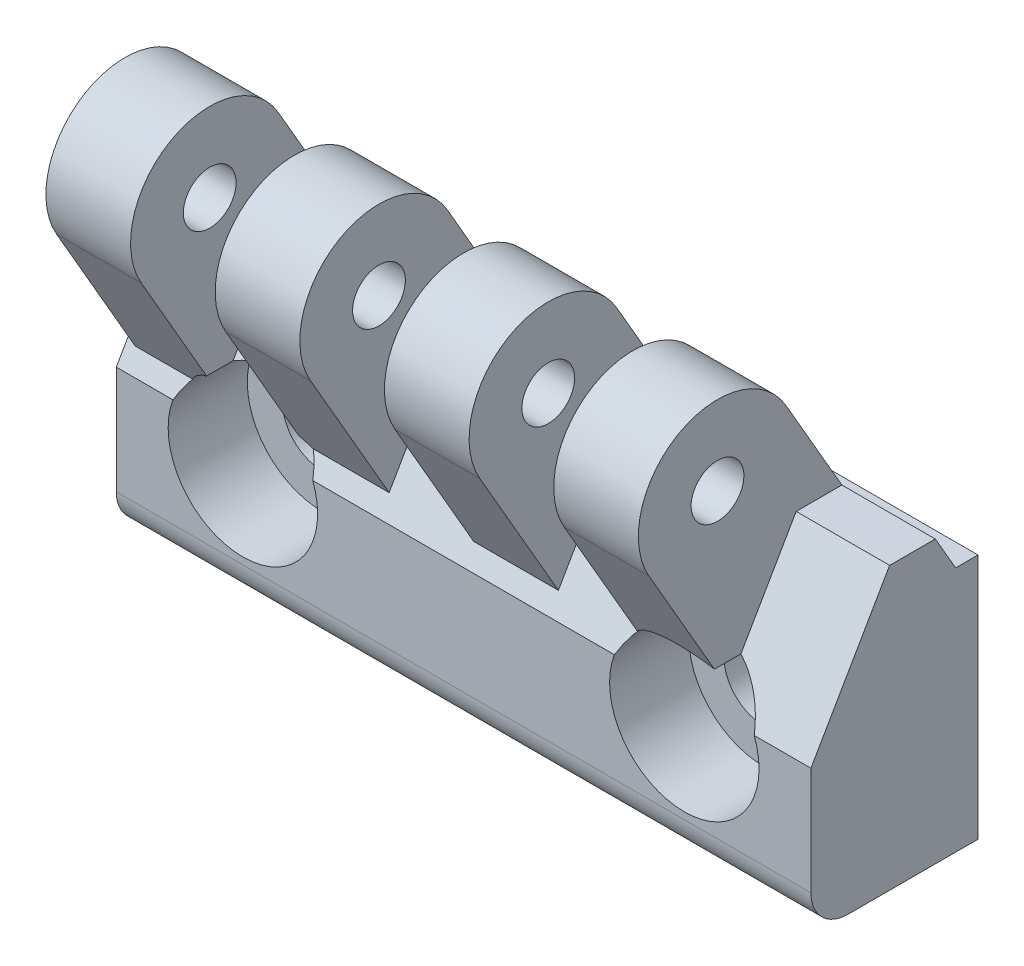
ISO-10303-21;
HEADER;
FILE_DESCRIPTION(('STEP AP214'),'2;1');
FILE_NAME('part.step','',(''),(''),'','','');
FILE_SCHEMA(('AUTOMOTIVE_DESIGN { 1 0 10303 214 1 1 1 1 }'));
ENDSEC;
DATA;
#1=APPLICATION_CONTEXT('core data for automotive mechanical design processes');
#2=APPLICATION_PROTOCOL_DEFINITION('international standard','automotive_design',2000,#1);
#3=PRODUCT_CONTEXT('',#1,'mechanical');
#4=PRODUCT('Part','Part','',(#3));
#5=PRODUCT_RELATED_PRODUCT_CATEGORY('part','',(#4));
#6=PRODUCT_DEFINITION_FORMATION('','',#4);
#7=PRODUCT_DEFINITION_CONTEXT('part definition',#1,'design');
#8=PRODUCT_DEFINITION('design','',#6,#7);
#9=PRODUCT_DEFINITION_SHAPE('','',#8);
#10=(LENGTH_UNIT() NAMED_UNIT(*) SI_UNIT(.MILLI.,.METRE.));
#11=(NAMED_UNIT(*) PLANE_ANGLE_UNIT() SI_UNIT($,.RADIAN.));
#12=(NAMED_UNIT(*) SI_UNIT($,.STERADIAN.) SOLID_ANGLE_UNIT());
#13=UNCERTAINTY_MEASURE_WITH_UNIT(LENGTH_MEASURE(1.E-05),#10,'distance_accuracy_value','');
#14=(GEOMETRIC_REPRESENTATION_CONTEXT(3) GLOBAL_UNCERTAINTY_ASSIGNED_CONTEXT((#13)) GLOBAL_UNIT_ASSIGNED_CONTEXT((#10,
#11,#12)) REPRESENTATION_CONTEXT('',''));
#15=CARTESIAN_POINT('',(0.,0.,0.));
#16=DIRECTION('',(0.,0.,1.));
#17=DIRECTION('',(1.,0.,0.));
#18=AXIS2_PLACEMENT_3D('',#15,#16,#17);
#19=CARTESIAN_POINT('',(32.3,9.25,5.0255354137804));
#20=DIRECTION('',(0.,-0.5,-0.866025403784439));
#21=DIRECTION('',(0.,0.866025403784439,-0.5));
#22=AXIS2_PLACEMENT_3D('',#19,#20,#21);
#23=PLANE('',#22);
#24=CARTESIAN_POINT('',(0.,0.,10.3660254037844));
#25=DIRECTION('',(0.,-0.5,-0.866025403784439));
#26=DIRECTION('',(0.,0.866025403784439,-0.5));
#27=AXIS2_PLACEMENT_3D('',#24,#25,#26);
#28=ELLIPSE('',#27,4.90747728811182,4.25);
#29=CARTESIAN_POINT('',(-3.4369317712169,2.5,8.92264973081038));
#30=VERTEX_POINT('',#29);
#31=CARTESIAN_POINT('',(-3.9764934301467,1.5,9.5));
#32=VERTEX_POINT('',#31);
#33=EDGE_CURVE('E560',#30,#32,#28,.F.);
#34=ORIENTED_EDGE('',*,*,#33,.F.);
#35=DIRECTION('',(-1.,0.,0.));
#36=VECTOR('',#35,1.);
#37=CARTESIAN_POINT('',(32.3,2.5,8.92264973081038));
#38=LINE('',#37,#36);
#39=CARTESIAN_POINT('',(-6.7,2.5,8.92264973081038));
#40=VERTEX_POINT('',#39);
#41=EDGE_CURVE('E240',#30,#40,#38,.T.);
#42=ORIENTED_EDGE('',*,*,#41,.T.);
#43=DIRECTION('',(0.,-0.866025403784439,0.5));
#44=VECTOR('',#43,1.);
#45=CARTESIAN_POINT('',(-6.7,9.25,5.0255354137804));
#46=LINE('',#45,#44);
#47=CARTESIAN_POINT('',(-6.7,9.25,5.0255354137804));
#48=VERTEX_POINT('',#47);
#49=EDGE_CURVE('E266',#48,#40,#46,.T.);
#50=ORIENTED_EDGE('',*,*,#49,.F.);
#51=DIRECTION('',(-1.,0.,0.));
#52=VECTOR('',#51,1.);
#53=CARTESIAN_POINT('',(32.3,9.25,5.0255354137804));
#54=LINE('',#53,#52);
#55=CARTESIAN_POINT('',(-7.2,9.25,5.0255354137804));
#56=VERTEX_POINT('',#55);
#57=EDGE_CURVE('E379',#48,#56,#54,.T.);
#58=ORIENTED_EDGE('',*,*,#57,.T.);
#59=DIRECTION('',(0.,-0.866025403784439,0.5));
#60=VECTOR('',#59,1.);
#61=CARTESIAN_POINT('',(-7.2,9.25,5.0255354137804));
#62=LINE('',#61,#60);
#63=CARTESIAN_POINT('',(-7.2,1.5,9.5));
#64=VERTEX_POINT('',#63);
#65=EDGE_CURVE('E369',#56,#64,#62,.T.);
#66=ORIENTED_EDGE('',*,*,#65,.T.);
#67=DIRECTION('',(-1.,0.,0.));
#68=VECTOR('',#67,1.);
#69=CARTESIAN_POINT('',(32.3,1.5,9.5));
#70=LINE('',#69,#68);
#71=EDGE_CURVE('E375',#32,#64,#70,.T.);
#72=ORIENTED_EDGE('',*,*,#71,.F.);
#73=EDGE_LOOP('',(#34,#42,#50,#58,#66,#72));
#74=FACE_BOUND('',#73,.T.);
#75=ADVANCED_FACE('F14',(#74),#23,.F.);
#76=CARTESIAN_POINT('',(3.97649343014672,1.5,9.5));
#77=VERTEX_POINT('',#76);
#78=CARTESIAN_POINT('',(3.43693177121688,2.5,8.92264973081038));
#79=VERTEX_POINT('',#78);
#80=EDGE_CURVE('E552',#77,#79,#28,.F.);
#81=ORIENTED_EDGE('',*,*,#80,.F.);
#82=CARTESIAN_POINT('',(21.1235065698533,1.5,9.5));
#83=VERTEX_POINT('',#82);
#84=EDGE_CURVE('E380',#83,#77,#70,.T.);
#85=ORIENTED_EDGE('',*,*,#84,.F.);
#86=CARTESIAN_POINT('',(25.1,0.,10.3660254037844));
#87=DIRECTION('',(0.,-0.5,-0.866025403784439));
#88=DIRECTION('',(0.,0.866025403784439,-0.5));
#89=AXIS2_PLACEMENT_3D('',#86,#87,#88);
#90=ELLIPSE('',#89,4.90747728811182,4.25);
#91=CARTESIAN_POINT('',(22.175,3.08332207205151,8.58586857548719));
#92=VERTEX_POINT('',#91);
#93=EDGE_CURVE('E427',#92,#83,#90,.F.);
#94=ORIENTED_EDGE('',*,*,#93,.F.);
#95=DIRECTION('',(0.,-0.866025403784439,0.5));
#96=VECTOR('',#95,1.);
#97=CARTESIAN_POINT('',(22.175,9.25,5.0255354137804));
#98=LINE('',#97,#96);
#99=CARTESIAN_POINT('',(22.175,9.25,5.0255354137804));
#100=VERTEX_POINT('',#99);
#101=EDGE_CURVE('E437',#100,#92,#98,.T.);
#102=ORIENTED_EDGE('',*,*,#101,.F.);
#103=CARTESIAN_POINT('',(17.3625,9.25,5.0255354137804));
#104=VERTEX_POINT('',#103);
#105=EDGE_CURVE('E385',#100,#104,#54,.T.);
#106=ORIENTED_EDGE('',*,*,#105,.T.);
#107=DIRECTION('',(0.,-0.866025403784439,0.5));
#108=VECTOR('',#107,1.);
#109=CARTESIAN_POINT('',(17.3625,9.25,5.0255354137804));
#110=LINE('',#109,#108);
#111=CARTESIAN_POINT('',(17.3625,2.5,8.92264973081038));
#112=VERTEX_POINT('',#111);
#113=EDGE_CURVE('E408',#104,#112,#110,.T.);
#114=ORIENTED_EDGE('',*,*,#113,.T.);
#115=DIRECTION('',(1.,0.,0.));
#116=VECTOR('',#115,1.);
#117=CARTESIAN_POINT('',(32.3,2.5,8.92264973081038));
#118=LINE('',#117,#116);
#119=CARTESIAN_POINT('',(12.55,2.5,8.92264973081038));
#120=VERTEX_POINT('',#119);
#121=EDGE_CURVE('E405',#120,#112,#118,.T.);
#122=ORIENTED_EDGE('',*,*,#121,.F.);
#123=DIRECTION('',(0.,-0.866025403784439,0.5));
#124=VECTOR('',#123,1.);
#125=CARTESIAN_POINT('',(12.55,9.25,5.0255354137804));
#126=LINE('',#125,#124);
#127=CARTESIAN_POINT('',(12.55,9.25,5.0255354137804));
#128=VERTEX_POINT('',#127);
#129=EDGE_CURVE('E402',#128,#120,#126,.T.);
#130=ORIENTED_EDGE('',*,*,#129,.F.);
#131=CARTESIAN_POINT('',(7.7375,9.25,5.0255354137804));
#132=VERTEX_POINT('',#131);
#133=EDGE_CURVE('E386',#128,#132,#54,.T.);
#134=ORIENTED_EDGE('',*,*,#133,.T.);
#135=DIRECTION('',(0.,-0.866025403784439,0.5));
#136=VECTOR('',#135,1.);
#137=CARTESIAN_POINT('',(7.7375,9.25,5.0255354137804));
#138=LINE('',#137,#136);
#139=CARTESIAN_POINT('',(7.7375,2.5,8.92264973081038));
#140=VERTEX_POINT('',#139);
#141=EDGE_CURVE('E410',#132,#140,#138,.T.);
#142=ORIENTED_EDGE('',*,*,#141,.T.);
#143=DIRECTION('',(-1.,0.,0.));
#144=VECTOR('',#143,1.);
#145=CARTESIAN_POINT('',(32.3,2.5,8.92264973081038));
#146=LINE('',#145,#144);
#147=EDGE_CURVE('E413',#140,#79,#146,.T.);
#148=ORIENTED_EDGE('',*,*,#147,.T.);
#149=EDGE_LOOP('',(#81,#85,#94,#102,#106,#114,#122,#130,#134,#142,#148));
#150=FACE_BOUND('',#149,.T.);
#151=ADVANCED_FACE('F436',(#150),#23,.F.);
#152=CARTESIAN_POINT('',(2.925,12.5000000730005,9.50000004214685));
#153=DIRECTION('',(1.,0.,0.));
#154=DIRECTION('',(0.,1.,0.));
#155=AXIS2_PLACEMENT_3D('',#152,#153,#154);
#156=PLANE('',#155);
#157=CARTESIAN_POINT('',(2.925,12.5,9.5));
#158=DIRECTION('',(1.,0.,0.));
#159=DIRECTION('',(0.,1.,0.));
#160=AXIS2_PLACEMENT_3D('',#157,#158,#159);
#161=CIRCLE('',#160,1.5);
#162=CARTESIAN_POINT('',(2.925,14.,9.5));
#163=VERTEX_POINT('',#162);
#164=EDGE_CURVE('E281',#163,#163,#161,.T.);
#165=ORIENTED_EDGE('',*,*,#164,.T.);
#166=EDGE_LOOP('',(#165));
#167=FACE_BOUND('',#166,.T.);
#168=DIRECTION('',(0.,0.,-1.));
#169=VECTOR('',#168,1.);
#170=CARTESIAN_POINT('',(2.925,3.08332207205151,0.));
#171=LINE('',#170,#169);
#172=CARTESIAN_POINT('',(2.925,3.08332207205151,9.25943088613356));
#173=VERTEX_POINT('',#172);
#174=CARTESIAN_POINT('',(2.925,3.08332207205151,8.58586857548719));
#175=VERTEX_POINT('',#174);
#176=EDGE_CURVE('E558',#173,#175,#171,.T.);
#177=ORIENTED_EDGE('',*,*,#176,.F.);
#178=DIRECTION('',(0.,-0.866025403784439,-0.5));
#179=VECTOR('',#178,1.);
#180=CARTESIAN_POINT('',(2.925,10.25,13.39711431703));
#181=LINE('',#180,#179);
#182=CARTESIAN_POINT('',(2.925,10.25,13.39711431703));
#183=VERTEX_POINT('',#182);
#184=EDGE_CURVE('E278',#183,#173,#181,.T.);
#185=ORIENTED_EDGE('',*,*,#184,.F.);
#186=CARTESIAN_POINT('',(2.925,12.5000000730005,9.50000004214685));
#187=DIRECTION('',(1.,0.,0.));
#188=DIRECTION('',(0.,1.,0.));
#189=AXIS2_PLACEMENT_3D('',#186,#187,#188);
#190=CIRCLE('',#189,4.5);
#191=CARTESIAN_POINT('',(2.925,14.75,5.60288568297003));
#192=VERTEX_POINT('',#191);
#193=EDGE_CURVE('E274',#192,#183,#190,.T.);
#194=ORIENTED_EDGE('',*,*,#193,.F.);
#195=DIRECTION('',(0.,0.866025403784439,0.5));
#196=VECTOR('',#195,1.);
#197=CARTESIAN_POINT('',(2.925,6.77756813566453,1.));
#198=LINE('',#197,#196);
#199=CARTESIAN_POINT('',(2.925,9.25,2.42745920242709));
#200=VERTEX_POINT('',#199);
#201=EDGE_CURVE('E272',#200,#192,#198,.T.);
#202=ORIENTED_EDGE('',*,*,#201,.F.);
#203=DIRECTION('',(0.,0.,1.));
#204=VECTOR('',#203,1.);
#205=CARTESIAN_POINT('',(2.925,9.25,2.42745920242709));
#206=LINE('',#205,#204);
#207=CARTESIAN_POINT('',(2.925,9.25,5.0255354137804));
#208=VERTEX_POINT('',#207);
#209=EDGE_CURVE('E300',#200,#208,#206,.T.);
#210=ORIENTED_EDGE('',*,*,#209,.T.);
#211=DIRECTION('',(0.,-0.866025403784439,0.5));
#212=VECTOR('',#211,1.);
#213=CARTESIAN_POINT('',(2.925,9.25,5.0255354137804));
#214=LINE('',#213,#212);
#215=EDGE_CURVE('E416',#208,#175,#214,.T.);
#216=ORIENTED_EDGE('',*,*,#215,.T.);
#217=EDGE_LOOP('',(#177,#185,#194,#202,#210,#216));
#218=FACE_BOUND('',#217,.T.);
#219=ADVANCED_FACE('F642',(#167,#218),#156,.F.);
#220=CARTESIAN_POINT('',(-1.8875,12.5000000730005,9.50000004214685));
#221=DIRECTION('',(1.,0.,0.));
#222=DIRECTION('',(0.,1.,0.));
#223=AXIS2_PLACEMENT_3D('',#220,#221,#222);
#224=PLANE('',#223);
#225=CARTESIAN_POINT('',(-1.8875,12.5,9.5));
#226=DIRECTION('',(1.,0.,0.));
#227=DIRECTION('',(0.,1.,0.));
#228=AXIS2_PLACEMENT_3D('',#225,#226,#227);
#229=CIRCLE('',#228,1.5);
#230=CARTESIAN_POINT('',(-1.8875,14.,9.5));
#231=VERTEX_POINT('',#230);
#232=EDGE_CURVE('E246',#231,#231,#229,.T.);
#233=ORIENTED_EDGE('',*,*,#232,.F.);
#234=EDGE_LOOP('',(#233));
#235=FACE_BOUND('',#234,.T.);
#236=DIRECTION('',(0.,-0.866025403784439,-0.5));
#237=VECTOR('',#236,1.);
#238=CARTESIAN_POINT('',(-1.8875,10.25,13.39711431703));
#239=LINE('',#238,#237);
#240=CARTESIAN_POINT('',(-1.8875,10.25,13.39711431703));
#241=VERTEX_POINT('',#240);
#242=CARTESIAN_POINT('',(-1.8875,3.80786603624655,9.67774653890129));
#243=VERTEX_POINT('',#242);
#244=EDGE_CURVE('E237',#241,#243,#239,.T.);
#245=ORIENTED_EDGE('',*,*,#244,.T.);
#246=DIRECTION('',(0.,0.,-1.));
#247=VECTOR('',#246,1.);
#248=CARTESIAN_POINT('',(-1.8875,3.80786603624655,0.));
#249=LINE('',#248,#247);
#250=CARTESIAN_POINT('',(-1.8875,3.80786603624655,8.16755292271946));
#251=VERTEX_POINT('',#250);
#252=EDGE_CURVE('E9',#243,#251,#249,.T.);
#253=ORIENTED_EDGE('',*,*,#252,.T.);
#254=DIRECTION('',(0.,-0.866025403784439,0.5));
#255=VECTOR('',#254,1.);
#256=CARTESIAN_POINT('',(-1.8875,9.25,5.0255354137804));
#257=LINE('',#256,#255);
#258=CARTESIAN_POINT('',(-1.8875,9.25,5.0255354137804));
#259=VERTEX_POINT('',#258);
#260=EDGE_CURVE('E261',#259,#251,#257,.T.);
#261=ORIENTED_EDGE('',*,*,#260,.F.);
#262=DIRECTION('',(0.,0.,1.));
#263=VECTOR('',#262,1.);
#264=CARTESIAN_POINT('',(-1.8875,9.25,2.42745920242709));
#265=LINE('',#264,#263);
#266=CARTESIAN_POINT('',(-1.8875,9.25,2.42745920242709));
#267=VERTEX_POINT('',#266);
#268=EDGE_CURVE('E263',#267,#259,#265,.T.);
#269=ORIENTED_EDGE('',*,*,#268,.F.);
#270=DIRECTION('',(0.,0.866025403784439,0.5));
#271=VECTOR('',#270,1.);
#272=CARTESIAN_POINT('',(-1.8875,6.77756813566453,1.));
#273=LINE('',#272,#271);
#274=CARTESIAN_POINT('',(-1.8875,14.75,5.60288568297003));
#275=VERTEX_POINT('',#274);
#276=EDGE_CURVE('E251',#267,#275,#273,.T.);
#277=ORIENTED_EDGE('',*,*,#276,.T.);
#278=CARTESIAN_POINT('',(-1.8875,12.5000000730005,9.50000004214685));
#279=DIRECTION('',(1.,0.,0.));
#280=DIRECTION('',(0.,1.,0.));
#281=AXIS2_PLACEMENT_3D('',#278,#279,#280);
#282=CIRCLE('',#281,4.5);
#283=EDGE_CURVE('E245',#275,#241,#282,.T.);
#284=ORIENTED_EDGE('',*,*,#283,.T.);
#285=EDGE_LOOP('',(#245,#253,#261,#269,#277,#284));
#286=FACE_BOUND('',#285,.T.);
#287=ADVANCED_FACE('F243',(#235,#286),#224,.T.);
#288=EDGE_CURVE('E29',#175,#251,#28,.F.);
#289=ORIENTED_EDGE('',*,*,#288,.F.);
#290=ORIENTED_EDGE('',*,*,#215,.F.);
#291=EDGE_CURVE('E482',#208,#259,#54,.T.);
#292=ORIENTED_EDGE('',*,*,#291,.T.);
#293=ORIENTED_EDGE('',*,*,#260,.T.);
#294=EDGE_LOOP('',(#289,#290,#292,#293));
#295=FACE_BOUND('',#294,.T.);
#296=ADVANCED_FACE('F643',(#295),#23,.F.);
#297=CARTESIAN_POINT('',(26.9875,12.5000000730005,9.50000004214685));
#298=DIRECTION('',(1.,0.,0.));
#299=DIRECTION('',(0.,1.,0.));
#300=AXIS2_PLACEMENT_3D('',#297,#298,#299);
#301=PLANE('',#300);
#302=CARTESIAN_POINT('',(26.9875,12.5,9.5));
#303=DIRECTION('',(1.,0.,0.));
#304=DIRECTION('',(0.,1.,0.));
#305=AXIS2_PLACEMENT_3D('',#302,#303,#304);
#306=CIRCLE('',#305,1.5);
#307=CARTESIAN_POINT('',(26.9875,14.,9.5));
#308=VERTEX_POINT('',#307);
#309=EDGE_CURVE('E518',#308,#308,#306,.T.);
#310=ORIENTED_EDGE('',*,*,#309,.F.);
#311=EDGE_LOOP('',(#310));
#312=FACE_BOUND('',#311,.T.);
#313=DIRECTION('',(0.,-0.866025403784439,-0.5));
#314=VECTOR('',#313,1.);
#315=CARTESIAN_POINT('',(26.9875,10.25,13.39711431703));
#316=LINE('',#315,#314);
#317=CARTESIAN_POINT('',(26.9875,10.25,13.39711431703));
#318=VERTEX_POINT('',#317);
#319=CARTESIAN_POINT('',(26.9875,3.80786603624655,9.67774653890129));
#320=VERTEX_POINT('',#319);
#321=EDGE_CURVE('E530',#318,#320,#316,.T.);
#322=ORIENTED_EDGE('',*,*,#321,.T.);
#323=DIRECTION('',(0.,0.,-1.));
#324=VECTOR('',#323,1.);
#325=CARTESIAN_POINT('',(26.9875,3.80786603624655,0.));
#326=LINE('',#325,#324);
#327=CARTESIAN_POINT('',(26.9875,3.80786603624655,8.16755292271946));
#328=VERTEX_POINT('',#327);
#329=EDGE_CURVE('E439',#320,#328,#326,.T.);
#330=ORIENTED_EDGE('',*,*,#329,.T.);
#331=DIRECTION('',(0.,-0.866025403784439,0.5));
#332=VECTOR('',#331,1.);
#333=CARTESIAN_POINT('',(26.9875,9.25,5.0255354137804));
#334=LINE('',#333,#332);
#335=CARTESIAN_POINT('',(26.9875,9.25,5.0255354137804));
#336=VERTEX_POINT('',#335);
#337=EDGE_CURVE('E444',#336,#328,#334,.T.);
#338=ORIENTED_EDGE('',*,*,#337,.F.);
#339=DIRECTION('',(0.,0.,1.));
#340=VECTOR('',#339,1.);
#341=CARTESIAN_POINT('',(26.9875,9.25,2.42745920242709));
#342=LINE('',#341,#340);
#343=CARTESIAN_POINT('',(26.9875,9.25,2.42745920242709));
#344=VERTEX_POINT('',#343);
#345=EDGE_CURVE('E423',#344,#336,#342,.T.);
#346=ORIENTED_EDGE('',*,*,#345,.F.);
#347=DIRECTION('',(0.,0.866025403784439,0.5));
#348=VECTOR('',#347,1.);
#349=CARTESIAN_POINT('',(26.9875,6.77756813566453,1.));
#350=LINE('',#349,#348);
#351=CARTESIAN_POINT('',(26.9875,14.75,5.60288568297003));
#352=VERTEX_POINT('',#351);
#353=EDGE_CURVE('E524',#344,#352,#350,.T.);
#354=ORIENTED_EDGE('',*,*,#353,.T.);
#355=CARTESIAN_POINT('',(26.9875,12.5000000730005,9.50000004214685));
#356=DIRECTION('',(1.,0.,0.));
#357=DIRECTION('',(0.,1.,0.));
#358=AXIS2_PLACEMENT_3D('',#355,#356,#357);
#359=CIRCLE('',#358,4.5);
#360=EDGE_CURVE('E534',#352,#318,#359,.T.);
#361=ORIENTED_EDGE('',*,*,#360,.T.);
#362=EDGE_LOOP('',(#322,#330,#338,#346,#354,#361));
#363=FACE_BOUND('',#362,.T.);
#364=ADVANCED_FACE('F618',(#312,#363),#301,.T.);
#365=CARTESIAN_POINT('',(22.175,12.5000000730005,9.50000004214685));
#366=DIRECTION('',(1.,0.,0.));
#367=DIRECTION('',(0.,1.,0.));
#368=AXIS2_PLACEMENT_3D('',#365,#366,#367);
#369=PLANE('',#368);
#370=CARTESIAN_POINT('',(22.175,12.5,9.5));
#371=DIRECTION('',(1.,0.,0.));
#372=DIRECTION('',(0.,1.,0.));
#373=AXIS2_PLACEMENT_3D('',#370,#371,#372);
#374=CIRCLE('',#373,1.5);
#375=CARTESIAN_POINT('',(22.175,14.,9.5));
#376=VERTEX_POINT('',#375);
#377=EDGE_CURVE('E522',#376,#376,#374,.T.);
#378=ORIENTED_EDGE('',*,*,#377,.T.);
#379=EDGE_LOOP('',(#378));
#380=FACE_BOUND('',#379,.T.);
#381=DIRECTION('',(0.,0.,-1.));
#382=VECTOR('',#381,1.);
#383=CARTESIAN_POINT('',(22.175,3.08332207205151,0.));
#384=LINE('',#383,#382);
#385=CARTESIAN_POINT('',(22.175,3.08332207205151,9.25943088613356));
#386=VERTEX_POINT('',#385);
#387=EDGE_CURVE('E22',#386,#92,#384,.T.);
#388=ORIENTED_EDGE('',*,*,#387,.F.);
#389=DIRECTION('',(0.,-0.866025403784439,-0.5));
#390=VECTOR('',#389,1.);
#391=CARTESIAN_POINT('',(22.175,10.25,13.39711431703));
#392=LINE('',#391,#390);
#393=CARTESIAN_POINT('',(22.175,10.25,13.39711431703));
#394=VERTEX_POINT('',#393);
#395=EDGE_CURVE('E514',#394,#386,#392,.T.);
#396=ORIENTED_EDGE('',*,*,#395,.F.);
#397=CARTESIAN_POINT('',(22.175,12.5000000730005,9.50000004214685));
#398=DIRECTION('',(1.,0.,0.));
#399=DIRECTION('',(0.,1.,0.));
#400=AXIS2_PLACEMENT_3D('',#397,#398,#399);
#401=CIRCLE('',#400,4.5);
#402=CARTESIAN_POINT('',(22.175,14.75,5.60288568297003));
#403=VERTEX_POINT('',#402);
#404=EDGE_CURVE('E512',#403,#394,#401,.T.);
#405=ORIENTED_EDGE('',*,*,#404,.F.);
#406=DIRECTION('',(0.,0.866025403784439,0.5));
#407=VECTOR('',#406,1.);
#408=CARTESIAN_POINT('',(22.175,6.77756813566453,1.));
#409=LINE('',#408,#407);
#410=CARTESIAN_POINT('',(22.175,9.25,2.42745920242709));
#411=VERTEX_POINT('',#410);
#412=EDGE_CURVE('E509',#411,#403,#409,.T.);
#413=ORIENTED_EDGE('',*,*,#412,.F.);
#414=DIRECTION('',(0.,0.,1.));
#415=VECTOR('',#414,1.);
#416=CARTESIAN_POINT('',(22.175,9.25,2.42745920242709));
#417=LINE('',#416,#415);
#418=EDGE_CURVE('E420',#411,#100,#417,.T.);
#419=ORIENTED_EDGE('',*,*,#418,.T.);
#420=ORIENTED_EDGE('',*,*,#101,.T.);
#421=EDGE_LOOP('',(#388,#396,#405,#413,#419,#420));
#422=FACE_BOUND('',#421,.T.);
#423=ADVANCED_FACE('F442',(#380,#422),#369,.F.);
#424=CARTESIAN_POINT('',(32.3,9.25,2.42745920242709));
#425=DIRECTION('',(0.,-1.,0.));
#426=DIRECTION('',(1.,0.,0.));
#427=AXIS2_PLACEMENT_3D('',#424,#425,#426);
#428=PLANE('',#427);
#429=ORIENTED_EDGE('',*,*,#418,.F.);
#430=DIRECTION('',(-1.,0.,0.));
#431=VECTOR('',#430,1.);
#432=CARTESIAN_POINT('',(32.3,9.25,2.42745920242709));
#433=LINE('',#432,#431);
#434=CARTESIAN_POINT('',(17.3625,9.25,2.42745920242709));
#435=VERTEX_POINT('',#434);
#436=EDGE_CURVE('E390',#411,#435,#433,.T.);
#437=ORIENTED_EDGE('',*,*,#436,.T.);
#438=DIRECTION('',(0.,0.,1.));
#439=VECTOR('',#438,1.);
#440=CARTESIAN_POINT('',(17.3625,9.25,2.42745920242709));
#441=LINE('',#440,#439);
#442=EDGE_CURVE('E331',#435,#104,#441,.T.);
#443=ORIENTED_EDGE('',*,*,#442,.T.);
#444=ORIENTED_EDGE('',*,*,#105,.F.);
#445=EDGE_LOOP('',(#429,#437,#443,#444));
#446=FACE_BOUND('',#445,.T.);
#447=ADVANCED_FACE('F654',(#446),#428,.F.);
#448=DIRECTION('',(0.,0.,1.));
#449=VECTOR('',#448,1.);
#450=CARTESIAN_POINT('',(-6.7,9.25,2.42745920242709));
#451=LINE('',#450,#449);
#452=CARTESIAN_POINT('',(-6.7,9.25,2.42745920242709));
#453=VERTEX_POINT('',#452);
#454=EDGE_CURVE('E269',#453,#48,#451,.T.);
#455=ORIENTED_EDGE('',*,*,#454,.F.);
#456=CARTESIAN_POINT('',(-7.2,9.25,2.42745920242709));
#457=VERTEX_POINT('',#456);
#458=EDGE_CURVE('E384',#453,#457,#433,.T.);
#459=ORIENTED_EDGE('',*,*,#458,.T.);
#460=DIRECTION('',(0.,0.,1.));
#461=VECTOR('',#460,1.);
#462=CARTESIAN_POINT('',(-7.2,9.25,2.42745920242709));
#463=LINE('',#462,#461);
#464=EDGE_CURVE('E366',#457,#56,#463,.T.);
#465=ORIENTED_EDGE('',*,*,#464,.T.);
#466=ORIENTED_EDGE('',*,*,#57,.F.);
#467=EDGE_LOOP('',(#455,#459,#465,#466));
#468=FACE_BOUND('',#467,.T.);
#469=ADVANCED_FACE('F479',(#468),#428,.F.);
#470=CARTESIAN_POINT('',(29.0764934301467,1.5,9.5));
#471=VERTEX_POINT('',#470);
#472=EDGE_CURVE('E441',#471,#328,#90,.F.);
#473=ORIENTED_EDGE('',*,*,#472,.F.);
#474=CARTESIAN_POINT('',(32.3,1.5,9.5));
#475=VERTEX_POINT('',#474);
#476=EDGE_CURVE('E376',#475,#471,#70,.T.);
#477=ORIENTED_EDGE('',*,*,#476,.F.);
#478=DIRECTION('',(0.,-0.866025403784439,0.5));
#479=VECTOR('',#478,1.);
#480=CARTESIAN_POINT('',(32.3,9.25,5.0255354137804));
#481=LINE('',#480,#479);
#482=CARTESIAN_POINT('',(32.3,9.25,5.0255354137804));
#483=VERTEX_POINT('',#482);
#484=EDGE_CURVE('E349',#483,#475,#481,.T.);
#485=ORIENTED_EDGE('',*,*,#484,.F.);
#486=EDGE_CURVE('E381',#483,#336,#54,.T.);
#487=ORIENTED_EDGE('',*,*,#486,.T.);
#488=ORIENTED_EDGE('',*,*,#337,.T.);
#489=EDGE_LOOP('',(#473,#477,#485,#487,#488));
#490=FACE_BOUND('',#489,.T.);
#491=ADVANCED_FACE('F614',(#490),#23,.F.);
#492=EDGE_CURVE('E673',#200,#267,#433,.T.);
#493=ORIENTED_EDGE('',*,*,#492,.T.);
#494=ORIENTED_EDGE('',*,*,#268,.T.);
#495=ORIENTED_EDGE('',*,*,#291,.F.);
#496=ORIENTED_EDGE('',*,*,#209,.F.);
#497=EDGE_LOOP('',(#493,#494,#495,#496));
#498=FACE_BOUND('',#497,.T.);
#499=ADVANCED_FACE('F647',(#498),#428,.F.);
#500=CARTESIAN_POINT('',(12.55,9.25,2.42745920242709));
#501=VERTEX_POINT('',#500);
#502=CARTESIAN_POINT('',(7.7375,9.25,2.42745920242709));
#503=VERTEX_POINT('',#502);
#504=EDGE_CURVE('E391',#501,#503,#433,.T.);
#505=ORIENTED_EDGE('',*,*,#504,.T.);
#506=DIRECTION('',(0.,0.,1.));
#507=VECTOR('',#506,1.);
#508=CARTESIAN_POINT('',(7.7375,9.25,2.42745920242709));
#509=LINE('',#508,#507);
#510=EDGE_CURVE('E297',#503,#132,#509,.T.);
#511=ORIENTED_EDGE('',*,*,#510,.T.);
#512=ORIENTED_EDGE('',*,*,#133,.F.);
#513=DIRECTION('',(0.,0.,1.));
#514=VECTOR('',#513,1.);
#515=CARTESIAN_POINT('',(12.55,9.25,2.42745920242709));
#516=LINE('',#515,#514);
#517=EDGE_CURVE('E328',#501,#128,#516,.T.);
#518=ORIENTED_EDGE('',*,*,#517,.F.);
#519=EDGE_LOOP('',(#505,#511,#512,#518));
#520=FACE_BOUND('',#519,.T.);
#521=ADVANCED_FACE('F488',(#520),#428,.F.);
#522=CARTESIAN_POINT('',(32.3,-4.6388888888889,7.38888888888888));
#523=DIRECTION('',(-1.,0.,0.));
#524=DIRECTION('',(0.,-1.,0.));
#525=AXIS2_PLACEMENT_3D('',#522,#523,#524);
#526=CYLINDRICAL_SURFACE('',#525,2.11111111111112);
#527=CARTESIAN_POINT('',(-7.2,-4.6388888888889,7.38888888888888));
#528=DIRECTION('',(1.,0.,0.));
#529=DIRECTION('',(0.,1.,0.));
#530=AXIS2_PLACEMENT_3D('',#527,#528,#529);
#531=CIRCLE('',#530,2.11111111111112);
#532=CARTESIAN_POINT('',(-7.2,-4.6388888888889,9.5));
#533=VERTEX_POINT('',#532);
#534=CARTESIAN_POINT('',(-7.2,-6.75,7.38888888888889));
#535=VERTEX_POINT('',#534);
#536=EDGE_CURVE('E334',#533,#535,#531,.T.);
#537=ORIENTED_EDGE('',*,*,#536,.T.);
#538=DIRECTION('',(-1.,0.,0.));
#539=VECTOR('',#538,1.);
#540=CARTESIAN_POINT('',(32.3,-6.75,7.38888888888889));
#541=LINE('',#540,#539);
#542=CARTESIAN_POINT('',(32.3,-6.75,7.38888888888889));
#543=VERTEX_POINT('',#542);
#544=EDGE_CURVE('E399',#543,#535,#541,.T.);
#545=ORIENTED_EDGE('',*,*,#544,.F.);
#546=CARTESIAN_POINT('',(32.3,-4.6388888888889,7.38888888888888));
#547=DIRECTION('',(1.,0.,0.));
#548=DIRECTION('',(0.,1.,0.));
#549=AXIS2_PLACEMENT_3D('',#546,#547,#548);
#550=CIRCLE('',#549,2.11111111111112);
#551=CARTESIAN_POINT('',(32.3,-4.6388888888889,9.5));
#552=VERTEX_POINT('',#551);
#553=EDGE_CURVE('E335',#552,#543,#550,.T.);
#554=ORIENTED_EDGE('',*,*,#553,.F.);
#555=DIRECTION('',(-1.,0.,0.));
#556=VECTOR('',#555,1.);
#557=CARTESIAN_POINT('',(32.3,-4.6388888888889,9.5));
#558=LINE('',#557,#556);
#559=EDGE_CURVE('E353',#552,#533,#558,.T.);
#560=ORIENTED_EDGE('',*,*,#559,.T.);
#561=EDGE_LOOP('',(#537,#545,#554,#560));
#562=FACE_BOUND('',#561,.T.);
#563=ADVANCED_FACE('F16',(#562),#526,.T.);
#564=CARTESIAN_POINT('',(32.3,-6.75,7.38888888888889));
#565=DIRECTION('',(0.,1.,0.));
#566=DIRECTION('',(-1.,0.,0.));
#567=AXIS2_PLACEMENT_3D('',#564,#565,#566);
#568=PLANE('',#567);
#569=DIRECTION('',(0.,0.,-1.));
#570=VECTOR('',#569,1.);
#571=CARTESIAN_POINT('',(-7.2,-6.75,7.38888888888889));
#572=LINE('',#571,#570);
#573=CARTESIAN_POINT('',(-7.2,-6.75,0.));
#574=VERTEX_POINT('',#573);
#575=EDGE_CURVE('E356',#535,#574,#572,.T.);
#576=ORIENTED_EDGE('',*,*,#575,.T.);
#577=DIRECTION('',(-1.,0.,0.));
#578=VECTOR('',#577,1.);
#579=CARTESIAN_POINT('',(32.3,-6.75,0.));
#580=LINE('',#579,#578);
#581=CARTESIAN_POINT('',(32.3,-6.75,0.));
#582=VERTEX_POINT('',#581);
#583=EDGE_CURVE('E396',#582,#574,#580,.T.);
#584=ORIENTED_EDGE('',*,*,#583,.F.);
#585=DIRECTION('',(0.,0.,-1.));
#586=VECTOR('',#585,1.);
#587=CARTESIAN_POINT('',(32.3,-6.75,7.38888888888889));
#588=LINE('',#587,#586);
#589=EDGE_CURVE('E338',#543,#582,#588,.T.);
#590=ORIENTED_EDGE('',*,*,#589,.F.);
#591=ORIENTED_EDGE('',*,*,#544,.T.);
#592=EDGE_LOOP('',(#576,#584,#590,#591));
#593=FACE_BOUND('',#592,.T.);
#594=ADVANCED_FACE('F578',(#593),#568,.F.);
#595=CARTESIAN_POINT('',(32.3,-6.75,0.));
#596=DIRECTION('',(0.,0.,1.));
#597=DIRECTION('',(1.,0.,0.));
#598=AXIS2_PLACEMENT_3D('',#595,#596,#597);
#599=PLANE('',#598);
#600=CARTESIAN_POINT('',(0.,0.,0.));
#601=DIRECTION('',(0.,0.,-1.));
#602=DIRECTION('',(-1.,0.,0.));
#603=AXIS2_PLACEMENT_3D('',#600,#601,#602);
#604=CIRCLE('',#603,2.25);
#605=CARTESIAN_POINT('',(-2.25,0.,0.));
#606=VERTEX_POINT('',#605);
#607=EDGE_CURVE('E567',#606,#606,#604,.T.);
#608=ORIENTED_EDGE('',*,*,#607,.F.);
#609=EDGE_LOOP('',(#608));
#610=FACE_BOUND('',#609,.T.);
#611=CARTESIAN_POINT('',(25.1,0.,0.));
#612=DIRECTION('',(0.,0.,-1.));
#613=DIRECTION('',(-1.,0.,0.));
#614=AXIS2_PLACEMENT_3D('',#611,#612,#613);
#615=CIRCLE('',#614,2.25);
#616=CARTESIAN_POINT('',(22.85,0.,0.));
#617=VERTEX_POINT('',#616);
#618=EDGE_CURVE('E549',#617,#617,#615,.T.);
#619=ORIENTED_EDGE('',*,*,#618,.F.);
#620=EDGE_LOOP('',(#619));
#621=FACE_BOUND('',#620,.T.);
#622=DIRECTION('',(0.,1.,0.));
#623=VECTOR('',#622,1.);
#624=CARTESIAN_POINT('',(-7.2,-6.75,0.));
#625=LINE('',#624,#623);
#626=CARTESIAN_POINT('',(-7.2,7.25,0.));
#627=VERTEX_POINT('',#626);
#628=EDGE_CURVE('E358',#574,#627,#625,.T.);
#629=ORIENTED_EDGE('',*,*,#628,.T.);
#630=DIRECTION('',(-1.,0.,0.));
#631=VECTOR('',#630,1.);
#632=CARTESIAN_POINT('',(32.3,7.25,0.));
#633=LINE('',#632,#631);
#634=CARTESIAN_POINT('',(32.3,7.25,0.));
#635=VERTEX_POINT('',#634);
#636=EDGE_CURVE('E393',#635,#627,#633,.T.);
#637=ORIENTED_EDGE('',*,*,#636,.F.);
#638=DIRECTION('',(0.,1.,0.));
#639=VECTOR('',#638,1.);
#640=CARTESIAN_POINT('',(32.3,-6.75,0.));
#641=LINE('',#640,#639);
#642=EDGE_CURVE('E341',#582,#635,#641,.T.);
#643=ORIENTED_EDGE('',*,*,#642,.F.);
#644=ORIENTED_EDGE('',*,*,#583,.T.);
#645=EDGE_LOOP('',(#629,#637,#643,#644));
#646=FACE_BOUND('',#645,.T.);
#647=ADVANCED_FACE('F574',(#610,#621,#646),#599,.F.);
#648=CARTESIAN_POINT('',(32.3,7.25,0.));
#649=DIRECTION('',(0.,-1.,0.));
#650=DIRECTION('',(1.,0.,0.));
#651=AXIS2_PLACEMENT_3D('',#648,#649,#650);
#652=PLANE('',#651);
#653=DIRECTION('',(0.,0.,1.));
#654=VECTOR('',#653,1.);
#655=CARTESIAN_POINT('',(-7.2,7.25,0.));
#656=LINE('',#655,#654);
#657=CARTESIAN_POINT('',(-7.2,7.25,1.27275866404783));
#658=VERTEX_POINT('',#657);
#659=EDGE_CURVE('E360',#627,#658,#656,.T.);
#660=ORIENTED_EDGE('',*,*,#659,.T.);
#661=DIRECTION('',(-1.,0.,0.));
#662=VECTOR('',#661,1.);
#663=CARTESIAN_POINT('',(32.3,7.25,1.27275866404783));
#664=LINE('',#663,#662);
#665=CARTESIAN_POINT('',(32.3,7.25,1.27275866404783));
#666=VERTEX_POINT('',#665);
#667=EDGE_CURVE('E389',#666,#658,#664,.T.);
#668=ORIENTED_EDGE('',*,*,#667,.F.);
#669=DIRECTION('',(0.,0.,1.));
#670=VECTOR('',#669,1.);
#671=CARTESIAN_POINT('',(32.3,7.25,0.));
#672=LINE('',#671,#670);
#673=EDGE_CURVE('E343',#635,#666,#672,.T.);
#674=ORIENTED_EDGE('',*,*,#673,.F.);
#675=ORIENTED_EDGE('',*,*,#636,.T.);
#676=EDGE_LOOP('',(#660,#668,#674,#675));
#677=FACE_BOUND('',#676,.T.);
#678=ADVANCED_FACE('F577',(#677),#652,.F.);
#679=CARTESIAN_POINT('',(32.3,7.25,1.27275866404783));
#680=DIRECTION('',(0.,-0.5,0.866025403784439));
#681=DIRECTION('',(0.,-0.866025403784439,-0.5));
#682=AXIS2_PLACEMENT_3D('',#679,#680,#681);
#683=PLANE('',#682);
#684=ORIENTED_EDGE('',*,*,#667,.T.);
#685=DIRECTION('',(0.,0.866025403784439,0.5));
#686=VECTOR('',#685,1.);
#687=CARTESIAN_POINT('',(-7.2,7.25,1.27275866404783));
#688=LINE('',#687,#686);
#689=EDGE_CURVE('E363',#658,#457,#688,.T.);
#690=ORIENTED_EDGE('',*,*,#689,.T.);
#691=ORIENTED_EDGE('',*,*,#458,.F.);
#692=DIRECTION('',(0.,0.866025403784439,0.5));
#693=VECTOR('',#692,1.);
#694=CARTESIAN_POINT('',(-6.7,6.77756813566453,1.));
#695=LINE('',#694,#693);
#696=CARTESIAN_POINT('',(-6.7,14.75,5.60288568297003));
#697=VERTEX_POINT('',#696);
#698=EDGE_CURVE('E249',#453,#697,#695,.T.);
#699=ORIENTED_EDGE('',*,*,#698,.T.);
#700=DIRECTION('',(1.,0.,0.));
#701=VECTOR('',#700,1.);
#702=CARTESIAN_POINT('',(-6.7,14.75,5.60288568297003));
#703=LINE('',#702,#701);
#704=EDGE_CURVE('E257',#697,#275,#703,.T.);
#705=ORIENTED_EDGE('',*,*,#704,.T.);
#706=ORIENTED_EDGE('',*,*,#276,.F.);
#707=ORIENTED_EDGE('',*,*,#492,.F.);
#708=ORIENTED_EDGE('',*,*,#201,.T.);
#709=DIRECTION('',(1.,0.,0.));
#710=VECTOR('',#709,1.);
#711=CARTESIAN_POINT('',(2.925,14.75,5.60288568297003));
#712=LINE('',#711,#710);
#713=CARTESIAN_POINT('',(7.7375,14.75,5.60288568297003));
#714=VERTEX_POINT('',#713);
#715=EDGE_CURVE('E294',#192,#714,#712,.T.);
#716=ORIENTED_EDGE('',*,*,#715,.T.);
#717=DIRECTION('',(0.,0.866025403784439,0.5));
#718=VECTOR('',#717,1.);
#719=CARTESIAN_POINT('',(7.7375,6.77756813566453,1.));
#720=LINE('',#719,#718);
#721=EDGE_CURVE('E271',#503,#714,#720,.T.);
#722=ORIENTED_EDGE('',*,*,#721,.F.);
#723=ORIENTED_EDGE('',*,*,#504,.F.);
#724=DIRECTION('',(0.,0.866025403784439,0.5));
#725=VECTOR('',#724,1.);
#726=CARTESIAN_POINT('',(12.55,6.77756813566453,1.));
#727=LINE('',#726,#725);
#728=CARTESIAN_POINT('',(12.55,14.75,5.60288568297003));
#729=VERTEX_POINT('',#728);
#730=EDGE_CURVE('E302',#501,#729,#727,.T.);
#731=ORIENTED_EDGE('',*,*,#730,.T.);
#732=DIRECTION('',(-1.,0.,0.));
#733=VECTOR('',#732,1.);
#734=CARTESIAN_POINT('',(17.3625,14.75,5.60288568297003));
#735=LINE('',#734,#733);
#736=CARTESIAN_POINT('',(17.3625,14.75,5.60288568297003));
#737=VERTEX_POINT('',#736);
#738=EDGE_CURVE('E325',#737,#729,#735,.T.);
#739=ORIENTED_EDGE('',*,*,#738,.F.);
#740=DIRECTION('',(0.,0.866025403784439,0.5));
#741=VECTOR('',#740,1.);
#742=CARTESIAN_POINT('',(17.3625,6.77756813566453,1.));
#743=LINE('',#742,#741);
#744=EDGE_CURVE('E303',#435,#737,#743,.T.);
#745=ORIENTED_EDGE('',*,*,#744,.F.);
#746=ORIENTED_EDGE('',*,*,#436,.F.);
#747=ORIENTED_EDGE('',*,*,#412,.T.);
#748=DIRECTION('',(-1.,0.,0.));
#749=VECTOR('',#748,1.);
#750=CARTESIAN_POINT('',(26.9875,14.75,5.60288568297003));
#751=LINE('',#750,#749);
#752=EDGE_CURVE('E445',#352,#403,#751,.T.);
#753=ORIENTED_EDGE('',*,*,#752,.F.);
#754=ORIENTED_EDGE('',*,*,#353,.F.);
#755=CARTESIAN_POINT('',(32.3,9.25,2.42745920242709));
#756=VERTEX_POINT('',#755);
#757=EDGE_CURVE('E387',#756,#344,#433,.T.);
#758=ORIENTED_EDGE('',*,*,#757,.F.);
#759=DIRECTION('',(0.,0.866025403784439,0.5));
#760=VECTOR('',#759,1.);
#761=CARTESIAN_POINT('',(32.3,7.25,1.27275866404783));
#762=LINE('',#761,#760);
#763=EDGE_CURVE('E345',#666,#756,#762,.T.);
#764=ORIENTED_EDGE('',*,*,#763,.F.);
#765=EDGE_LOOP('',(#684,#690,#691,#699,#705,#706,#707,#708,#716,#722,#723,#731,#739,#745,#746,
#747,#753,#754,#758,#764));
#766=FACE_BOUND('',#765,.T.);
#767=ADVANCED_FACE('F466',(#766),#683,.F.);
#768=ORIENTED_EDGE('',*,*,#757,.T.);
#769=ORIENTED_EDGE('',*,*,#345,.T.);
#770=ORIENTED_EDGE('',*,*,#486,.F.);
#771=DIRECTION('',(0.,0.,1.));
#772=VECTOR('',#771,1.);
#773=CARTESIAN_POINT('',(32.3,9.25,2.42745920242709));
#774=LINE('',#773,#772);
#775=EDGE_CURVE('E347',#756,#483,#774,.T.);
#776=ORIENTED_EDGE('',*,*,#775,.F.);
#777=EDGE_LOOP('',(#768,#769,#770,#776));
#778=FACE_BOUND('',#777,.T.);
#779=ADVANCED_FACE('F722',(#778),#428,.F.);
#780=CARTESIAN_POINT('',(32.3,1.5,9.5));
#781=DIRECTION('',(0.,0.,-1.));
#782=DIRECTION('',(-1.,0.,0.));
#783=AXIS2_PLACEMENT_3D('',#780,#781,#782);
#784=PLANE('',#783);
#785=CARTESIAN_POINT('',(0.,0.,9.5));
#786=DIRECTION('',(0.,0.,-1.));
#787=DIRECTION('',(-1.,0.,0.));
#788=AXIS2_PLACEMENT_3D('',#785,#786,#787);
#789=CIRCLE('',#788,4.25);
#790=EDGE_CURVE('E553',#32,#77,#789,.F.);
#791=ORIENTED_EDGE('',*,*,#790,.F.);
#792=ORIENTED_EDGE('',*,*,#71,.T.);
#793=DIRECTION('',(0.,-1.,0.));
#794=VECTOR('',#793,1.);
#795=CARTESIAN_POINT('',(-7.2,1.5,9.5));
#796=LINE('',#795,#794);
#797=EDGE_CURVE('E339',#64,#533,#796,.T.);
#798=ORIENTED_EDGE('',*,*,#797,.T.);
#799=ORIENTED_EDGE('',*,*,#559,.F.);
#800=DIRECTION('',(0.,-1.,0.));
#801=VECTOR('',#800,1.);
#802=CARTESIAN_POINT('',(32.3,1.5,9.5));
#803=LINE('',#802,#801);
#804=EDGE_CURVE('E351',#475,#552,#803,.T.);
#805=ORIENTED_EDGE('',*,*,#804,.F.);
#806=ORIENTED_EDGE('',*,*,#476,.T.);
#807=CARTESIAN_POINT('',(25.1,0.,9.5));
#808=DIRECTION('',(0.,0.,-1.));
#809=DIRECTION('',(-1.,0.,0.));
#810=AXIS2_PLACEMENT_3D('',#807,#808,#809);
#811=CIRCLE('',#810,4.25);
#812=EDGE_CURVE('E516',#83,#471,#811,.F.);
#813=ORIENTED_EDGE('',*,*,#812,.F.);
#814=ORIENTED_EDGE('',*,*,#84,.T.);
#815=EDGE_LOOP('',(#791,#792,#798,#799,#805,#806,#813,#814));
#816=FACE_BOUND('',#815,.T.);
#817=ADVANCED_FACE('F609',(#816),#784,.F.);
#818=CARTESIAN_POINT('',(32.3,-4.6388888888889,7.38888888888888));
#819=DIRECTION('',(1.,0.,0.));
#820=DIRECTION('',(0.,1.,0.));
#821=AXIS2_PLACEMENT_3D('',#818,#819,#820);
#822=PLANE('',#821);
#823=ORIENTED_EDGE('',*,*,#553,.T.);
#824=ORIENTED_EDGE('',*,*,#589,.T.);
#825=ORIENTED_EDGE('',*,*,#642,.T.);
#826=ORIENTED_EDGE('',*,*,#673,.T.);
#827=ORIENTED_EDGE('',*,*,#763,.T.);
#828=ORIENTED_EDGE('',*,*,#775,.T.);
#829=ORIENTED_EDGE('',*,*,#484,.T.);
#830=ORIENTED_EDGE('',*,*,#804,.T.);
#831=EDGE_LOOP('',(#823,#824,#825,#826,#827,#828,#829,#830));
#832=FACE_BOUND('',#831,.T.);
#833=ADVANCED_FACE('F599',(#832),#822,.T.);
#834=CARTESIAN_POINT('',(-7.2,-4.6388888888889,7.38888888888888));
#835=DIRECTION('',(1.,0.,0.));
#836=DIRECTION('',(0.,1.,0.));
#837=AXIS2_PLACEMENT_3D('',#834,#835,#836);
#838=PLANE('',#837);
#839=ORIENTED_EDGE('',*,*,#536,.F.);
#840=ORIENTED_EDGE('',*,*,#797,.F.);
#841=ORIENTED_EDGE('',*,*,#65,.F.);
#842=ORIENTED_EDGE('',*,*,#464,.F.);
#843=ORIENTED_EDGE('',*,*,#689,.F.);
#844=ORIENTED_EDGE('',*,*,#659,.F.);
#845=ORIENTED_EDGE('',*,*,#628,.F.);
#846=ORIENTED_EDGE('',*,*,#575,.F.);
#847=EDGE_LOOP('',(#839,#840,#841,#842,#843,#844,#845,#846));
#848=FACE_BOUND('',#847,.T.);
#849=ADVANCED_FACE('F593',(#848),#838,.F.);
#850=CARTESIAN_POINT('',(17.3625,10.25,13.39711431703));
#851=DIRECTION('',(0.,0.5,-0.866025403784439));
#852=DIRECTION('',(0.,0.866025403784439,0.5));
#853=AXIS2_PLACEMENT_3D('',#850,#851,#852);
#854=PLANE('',#853);
#855=DIRECTION('',(0.,-0.866025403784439,-0.5));
#856=VECTOR('',#855,1.);
#857=CARTESIAN_POINT('',(12.55,10.25,13.39711431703));
#858=LINE('',#857,#856);
#859=CARTESIAN_POINT('',(12.55,10.25,13.39711431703));
#860=VERTEX_POINT('',#859);
#861=EDGE_CURVE('E318',#860,#120,#858,.T.);
#862=ORIENTED_EDGE('',*,*,#861,.T.);
#863=ORIENTED_EDGE('',*,*,#121,.T.);
#864=DIRECTION('',(0.,-0.866025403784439,-0.5));
#865=VECTOR('',#864,1.);
#866=CARTESIAN_POINT('',(17.3625,10.25,13.39711431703));
#867=LINE('',#866,#865);
#868=CARTESIAN_POINT('',(17.3625,10.25,13.39711431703));
#869=VERTEX_POINT('',#868);
#870=EDGE_CURVE('E308',#869,#112,#867,.T.);
#871=ORIENTED_EDGE('',*,*,#870,.F.);
#872=DIRECTION('',(-1.,0.,0.));
#873=VECTOR('',#872,1.);
#874=CARTESIAN_POINT('',(17.3625,10.25,13.39711431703));
#875=LINE('',#874,#873);
#876=EDGE_CURVE('E314',#869,#860,#875,.T.);
#877=ORIENTED_EDGE('',*,*,#876,.T.);
#878=EDGE_LOOP('',(#862,#863,#871,#877));
#879=FACE_BOUND('',#878,.T.);
#880=ADVANCED_FACE('F705',(#879),#854,.F.);
#881=CARTESIAN_POINT('',(17.3625,12.5000000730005,9.50000004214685));
#882=DIRECTION('',(1.,0.,0.));
#883=DIRECTION('',(0.,1.,0.));
#884=AXIS2_PLACEMENT_3D('',#881,#882,#883);
#885=PLANE('',#884);
#886=CARTESIAN_POINT('',(17.3625,12.5,9.5));
#887=DIRECTION('',(1.,0.,0.));
#888=DIRECTION('',(0.,1.,0.));
#889=AXIS2_PLACEMENT_3D('',#886,#887,#888);
#890=CIRCLE('',#889,1.5);
#891=CARTESIAN_POINT('',(17.3625,14.,9.5));
#892=VERTEX_POINT('',#891);
#893=EDGE_CURVE('E311',#892,#892,#890,.T.);
#894=ORIENTED_EDGE('',*,*,#893,.F.);
#895=EDGE_LOOP('',(#894));
#896=FACE_BOUND('',#895,.T.);
#897=ORIENTED_EDGE('',*,*,#442,.F.);
#898=ORIENTED_EDGE('',*,*,#744,.T.);
#899=CARTESIAN_POINT('',(17.3625,12.5000000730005,9.50000004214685));
#900=DIRECTION('',(1.,0.,0.));
#901=DIRECTION('',(0.,1.,0.));
#902=AXIS2_PLACEMENT_3D('',#899,#900,#901);
#903=CIRCLE('',#902,4.5);
#904=EDGE_CURVE('E305',#737,#869,#903,.T.);
#905=ORIENTED_EDGE('',*,*,#904,.T.);
#906=ORIENTED_EDGE('',*,*,#870,.T.);
#907=ORIENTED_EDGE('',*,*,#113,.F.);
#908=EDGE_LOOP('',(#897,#898,#905,#906,#907));
#909=FACE_BOUND('',#908,.T.);
#910=ADVANCED_FACE('F505',(#896,#909),#885,.T.);
#911=CARTESIAN_POINT('',(12.55,12.5000000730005,9.50000004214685));
#912=DIRECTION('',(1.,0.,0.));
#913=DIRECTION('',(0.,1.,0.));
#914=AXIS2_PLACEMENT_3D('',#911,#912,#913);
#915=PLANE('',#914);
#916=CARTESIAN_POINT('',(12.55,12.5,9.5));
#917=DIRECTION('',(1.,0.,0.));
#918=DIRECTION('',(0.,1.,0.));
#919=AXIS2_PLACEMENT_3D('',#916,#917,#918);
#920=CIRCLE('',#919,1.5);
#921=CARTESIAN_POINT('',(12.55,14.,9.5));
#922=VERTEX_POINT('',#921);
#923=EDGE_CURVE('E306',#922,#922,#920,.T.);
#924=ORIENTED_EDGE('',*,*,#923,.T.);
#925=EDGE_LOOP('',(#924));
#926=FACE_BOUND('',#925,.T.);
#927=ORIENTED_EDGE('',*,*,#730,.F.);
#928=ORIENTED_EDGE('',*,*,#517,.T.);
#929=ORIENTED_EDGE('',*,*,#129,.T.);
#930=ORIENTED_EDGE('',*,*,#861,.F.);
#931=CARTESIAN_POINT('',(12.55,12.5000000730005,9.50000004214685));
#932=DIRECTION('',(1.,0.,0.));
#933=DIRECTION('',(0.,1.,0.));
#934=AXIS2_PLACEMENT_3D('',#931,#932,#933);
#935=CIRCLE('',#934,4.5);
#936=EDGE_CURVE('E316',#729,#860,#935,.T.);
#937=ORIENTED_EDGE('',*,*,#936,.F.);
#938=EDGE_LOOP('',(#927,#928,#929,#930,#937));
#939=FACE_BOUND('',#938,.T.);
#940=ADVANCED_FACE('F492',(#926,#939),#915,.F.);
#941=CARTESIAN_POINT('',(17.3625,12.5000000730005,9.50000004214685));
#942=DIRECTION('',(-1.,0.,0.));
#943=DIRECTION('',(0.,-1.,0.));
#944=AXIS2_PLACEMENT_3D('',#941,#942,#943);
#945=CYLINDRICAL_SURFACE('',#944,4.5);
#946=ORIENTED_EDGE('',*,*,#936,.T.);
#947=ORIENTED_EDGE('',*,*,#876,.F.);
#948=ORIENTED_EDGE('',*,*,#904,.F.);
#949=ORIENTED_EDGE('',*,*,#738,.T.);
#950=EDGE_LOOP('',(#946,#947,#948,#949));
#951=FACE_BOUND('',#950,.T.);
#952=ADVANCED_FACE('F500',(#951),#945,.T.);
#953=CARTESIAN_POINT('',(17.3625,12.5,9.5));
#954=DIRECTION('',(-1.,0.,0.));
#955=DIRECTION('',(0.,-1.,0.));
#956=AXIS2_PLACEMENT_3D('',#953,#954,#955);
#957=CYLINDRICAL_SURFACE('',#956,1.5);
#958=ORIENTED_EDGE('',*,*,#893,.T.);
#959=EDGE_LOOP('',(#958));
#960=FACE_BOUND('',#959,.T.);
#961=ORIENTED_EDGE('',*,*,#923,.F.);
#962=EDGE_LOOP('',(#961));
#963=FACE_BOUND('',#962,.T.);
#964=ADVANCED_FACE('F694',(#960,#963),#957,.F.);
#965=CARTESIAN_POINT('',(2.925,10.25,13.39711431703));
#966=DIRECTION('',(0.,-0.5,0.866025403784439));
#967=DIRECTION('',(0.,-0.866025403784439,-0.5));
#968=AXIS2_PLACEMENT_3D('',#965,#966,#967);
#969=PLANE('',#968);
#970=ORIENTED_EDGE('',*,*,#184,.T.);
#971=CARTESIAN_POINT('',(0.,0.,7.47927405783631));
#972=DIRECTION('',(0.,-0.5,0.866025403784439));
#973=DIRECTION('',(0.,-0.866025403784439,-0.5));
#974=AXIS2_PLACEMENT_3D('',#971,#972,#973);
#975=ELLIPSE('',#974,4.90747728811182,4.25);
#976=EDGE_CURVE('E555',#173,#79,#975,.F.);
#977=ORIENTED_EDGE('',*,*,#976,.T.);
#978=ORIENTED_EDGE('',*,*,#147,.F.);
#979=DIRECTION('',(0.,-0.866025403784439,-0.5));
#980=VECTOR('',#979,1.);
#981=CARTESIAN_POINT('',(7.7375,10.25,13.39711431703));
#982=LINE('',#981,#980);
#983=CARTESIAN_POINT('',(7.7375,10.25,13.39711431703));
#984=VERTEX_POINT('',#983);
#985=EDGE_CURVE('E289',#984,#140,#982,.T.);
#986=ORIENTED_EDGE('',*,*,#985,.F.);
#987=DIRECTION('',(1.,0.,0.));
#988=VECTOR('',#987,1.);
#989=CARTESIAN_POINT('',(2.925,10.25,13.39711431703));
#990=LINE('',#989,#988);
#991=EDGE_CURVE('E284',#183,#984,#990,.T.);
#992=ORIENTED_EDGE('',*,*,#991,.F.);
#993=EDGE_LOOP('',(#970,#977,#978,#986,#992));
#994=FACE_BOUND('',#993,.T.);
#995=ADVANCED_FACE('F679',(#994),#969,.T.);
#996=CARTESIAN_POINT('',(7.7375,12.5000000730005,9.50000004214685));
#997=DIRECTION('',(1.,0.,0.));
#998=DIRECTION('',(0.,1.,0.));
#999=AXIS2_PLACEMENT_3D('',#996,#997,#998);
#1000=PLANE('',#999);
#1001=CARTESIAN_POINT('',(7.7375,12.5,9.5));
#1002=DIRECTION('',(1.,0.,0.));
#1003=DIRECTION('',(0.,1.,0.));
#1004=AXIS2_PLACEMENT_3D('',#1001,#1002,#1003);
#1005=CIRCLE('',#1004,1.5);
#1006=CARTESIAN_POINT('',(7.7375,14.,9.5));
#1007=VERTEX_POINT('',#1006);
#1008=EDGE_CURVE('E275',#1007,#1007,#1005,.T.);
#1009=ORIENTED_EDGE('',*,*,#1008,.F.);
#1010=EDGE_LOOP('',(#1009));
#1011=FACE_BOUND('',#1010,.T.);
#1012=ORIENTED_EDGE('',*,*,#510,.F.);
#1013=ORIENTED_EDGE('',*,*,#721,.T.);
#1014=CARTESIAN_POINT('',(7.7375,12.5000000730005,9.50000004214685));
#1015=DIRECTION('',(1.,0.,0.));
#1016=DIRECTION('',(0.,1.,0.));
#1017=AXIS2_PLACEMENT_3D('',#1014,#1015,#1016);
#1018=CIRCLE('',#1017,4.5);
#1019=EDGE_CURVE('E286',#714,#984,#1018,.T.);
#1020=ORIENTED_EDGE('',*,*,#1019,.T.);
#1021=ORIENTED_EDGE('',*,*,#985,.T.);
#1022=ORIENTED_EDGE('',*,*,#141,.F.);
#1023=EDGE_LOOP('',(#1012,#1013,#1020,#1021,#1022));
#1024=FACE_BOUND('',#1023,.T.);
#1025=ADVANCED_FACE('F683',(#1011,#1024),#1000,.T.);
#1026=CARTESIAN_POINT('',(2.925,12.5000000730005,9.50000004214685));
#1027=DIRECTION('',(1.,0.,0.));
#1028=DIRECTION('',(0.,1.,0.));
#1029=AXIS2_PLACEMENT_3D('',#1026,#1027,#1028);
#1030=CYLINDRICAL_SURFACE('',#1029,4.5);
#1031=ORIENTED_EDGE('',*,*,#1019,.F.);
#1032=ORIENTED_EDGE('',*,*,#715,.F.);
#1033=ORIENTED_EDGE('',*,*,#193,.T.);
#1034=ORIENTED_EDGE('',*,*,#991,.T.);
#1035=EDGE_LOOP('',(#1031,#1032,#1033,#1034));
#1036=FACE_BOUND('',#1035,.T.);
#1037=ADVANCED_FACE('F677',(#1036),#1030,.T.);
#1038=CARTESIAN_POINT('',(2.925,12.5,9.5));
#1039=DIRECTION('',(1.,0.,0.));
#1040=DIRECTION('',(0.,1.,0.));
#1041=AXIS2_PLACEMENT_3D('',#1038,#1039,#1040);
#1042=CYLINDRICAL_SURFACE('',#1041,1.5);
#1043=ORIENTED_EDGE('',*,*,#164,.F.);
#1044=EDGE_LOOP('',(#1043));
#1045=FACE_BOUND('',#1044,.T.);
#1046=ORIENTED_EDGE('',*,*,#1008,.T.);
#1047=EDGE_LOOP('',(#1046));
#1048=FACE_BOUND('',#1047,.T.);
#1049=ADVANCED_FACE('F692',(#1045,#1048),#1042,.F.);
#1050=CARTESIAN_POINT('',(-6.7,10.25,13.39711431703));
#1051=DIRECTION('',(0.,-0.5,0.866025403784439));
#1052=DIRECTION('',(0.,-0.866025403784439,-0.5));
#1053=AXIS2_PLACEMENT_3D('',#1050,#1051,#1052);
#1054=PLANE('',#1053);
#1055=ORIENTED_EDGE('',*,*,#41,.F.);
#1056=CARTESIAN_POINT('',(0.,0.,7.47927405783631));
#1057=DIRECTION('',(0.,-0.5,0.866025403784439));
#1058=DIRECTION('',(0.,-0.866025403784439,-0.5));
#1059=AXIS2_PLACEMENT_3D('',#1056,#1057,#1058);
#1060=ELLIPSE('',#1059,4.90747728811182,4.25);
#1061=EDGE_CURVE('E228',#30,#243,#1060,.F.);
#1062=ORIENTED_EDGE('',*,*,#1061,.T.);
#1063=ORIENTED_EDGE('',*,*,#244,.F.);
#1064=DIRECTION('',(1.,0.,0.));
#1065=VECTOR('',#1064,1.);
#1066=CARTESIAN_POINT('',(-6.7,10.25,13.39711431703));
#1067=LINE('',#1066,#1065);
#1068=CARTESIAN_POINT('',(-6.7,10.25,13.39711431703));
#1069=VERTEX_POINT('',#1068);
#1070=EDGE_CURVE('E255',#1069,#241,#1067,.T.);
#1071=ORIENTED_EDGE('',*,*,#1070,.F.);
#1072=DIRECTION('',(0.,-0.866025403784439,-0.5));
#1073=VECTOR('',#1072,1.);
#1074=CARTESIAN_POINT('',(-6.7,10.25,13.39711431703));
#1075=LINE('',#1074,#1073);
#1076=EDGE_CURVE('E458',#1069,#40,#1075,.T.);
#1077=ORIENTED_EDGE('',*,*,#1076,.T.);
#1078=EDGE_LOOP('',(#1055,#1062,#1063,#1071,#1077));
#1079=FACE_BOUND('',#1078,.T.);
#1080=ADVANCED_FACE('F236',(#1079),#1054,.T.);
#1081=CARTESIAN_POINT('',(-6.7,12.5000000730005,9.50000004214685));
#1082=DIRECTION('',(1.,0.,0.));
#1083=DIRECTION('',(0.,1.,0.));
#1084=AXIS2_PLACEMENT_3D('',#1081,#1082,#1083);
#1085=PLANE('',#1084);
#1086=CARTESIAN_POINT('',(-6.7,12.5,9.5));
#1087=DIRECTION('',(1.,0.,0.));
#1088=DIRECTION('',(0.,1.,0.));
#1089=AXIS2_PLACEMENT_3D('',#1086,#1087,#1088);
#1090=CIRCLE('',#1089,1.5);
#1091=CARTESIAN_POINT('',(-6.7,14.,9.5));
#1092=VERTEX_POINT('',#1091);
#1093=EDGE_CURVE('E258',#1092,#1092,#1090,.T.);
#1094=ORIENTED_EDGE('',*,*,#1093,.T.);
#1095=EDGE_LOOP('',(#1094));
#1096=FACE_BOUND('',#1095,.T.);
#1097=ORIENTED_EDGE('',*,*,#698,.F.);
#1098=ORIENTED_EDGE('',*,*,#454,.T.);
#1099=ORIENTED_EDGE('',*,*,#49,.T.);
#1100=ORIENTED_EDGE('',*,*,#1076,.F.);
#1101=CARTESIAN_POINT('',(-6.7,12.5000000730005,9.50000004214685));
#1102=DIRECTION('',(1.,0.,0.));
#1103=DIRECTION('',(0.,1.,0.));
#1104=AXIS2_PLACEMENT_3D('',#1101,#1102,#1103);
#1105=CIRCLE('',#1104,4.5);
#1106=EDGE_CURVE('E455',#697,#1069,#1105,.T.);
#1107=ORIENTED_EDGE('',*,*,#1106,.F.);
#1108=EDGE_LOOP('',(#1097,#1098,#1099,#1100,#1107));
#1109=FACE_BOUND('',#1108,.T.);
#1110=ADVANCED_FACE('F473',(#1096,#1109),#1085,.F.);
#1111=CARTESIAN_POINT('',(-6.7,12.5000000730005,9.50000004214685));
#1112=DIRECTION('',(1.,0.,0.));
#1113=DIRECTION('',(0.,1.,0.));
#1114=AXIS2_PLACEMENT_3D('',#1111,#1112,#1113);
#1115=CYLINDRICAL_SURFACE('',#1114,4.5);
#1116=ORIENTED_EDGE('',*,*,#283,.F.);
#1117=ORIENTED_EDGE('',*,*,#704,.F.);
#1118=ORIENTED_EDGE('',*,*,#1106,.T.);
#1119=ORIENTED_EDGE('',*,*,#1070,.T.);
#1120=EDGE_LOOP('',(#1116,#1117,#1118,#1119));
#1121=FACE_BOUND('',#1120,.T.);
#1122=ADVANCED_FACE('F470',(#1121),#1115,.T.);
#1123=CARTESIAN_POINT('',(-6.7,12.5,9.5));
#1124=DIRECTION('',(1.,0.,0.));
#1125=DIRECTION('',(0.,1.,0.));
#1126=AXIS2_PLACEMENT_3D('',#1123,#1124,#1125);
#1127=CYLINDRICAL_SURFACE('',#1126,1.5);
#1128=ORIENTED_EDGE('',*,*,#1093,.F.);
#1129=EDGE_LOOP('',(#1128));
#1130=FACE_BOUND('',#1129,.T.);
#1131=ORIENTED_EDGE('',*,*,#232,.T.);
#1132=EDGE_LOOP('',(#1131));
#1133=FACE_BOUND('',#1132,.T.);
#1134=ADVANCED_FACE('F622',(#1130,#1133),#1127,.F.);
#1135=CARTESIAN_POINT('',(26.9875,10.25,13.39711431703));
#1136=DIRECTION('',(0.,0.5,-0.866025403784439));
#1137=DIRECTION('',(0.,0.866025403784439,0.5));
#1138=AXIS2_PLACEMENT_3D('',#1135,#1136,#1137);
#1139=PLANE('',#1138);
#1140=CARTESIAN_POINT('',(25.1,0.,7.47927405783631));
#1141=DIRECTION('',(0.,0.5,-0.866025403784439));
#1142=DIRECTION('',(0.,-0.866025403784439,-0.5));
#1143=AXIS2_PLACEMENT_3D('',#1140,#1141,#1142);
#1144=ELLIPSE('',#1143,4.90747728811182,4.25);
#1145=EDGE_CURVE('E36',#320,#386,#1144,.F.);
#1146=ORIENTED_EDGE('',*,*,#1145,.F.);
#1147=ORIENTED_EDGE('',*,*,#321,.F.);
#1148=DIRECTION('',(-1.,0.,0.));
#1149=VECTOR('',#1148,1.);
#1150=CARTESIAN_POINT('',(26.9875,10.25,13.39711431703));
#1151=LINE('',#1150,#1149);
#1152=EDGE_CURVE('E450',#318,#394,#1151,.T.);
#1153=ORIENTED_EDGE('',*,*,#1152,.T.);
#1154=ORIENTED_EDGE('',*,*,#395,.T.);
#1155=EDGE_LOOP('',(#1146,#1147,#1153,#1154));
#1156=FACE_BOUND('',#1155,.T.);
#1157=ADVANCED_FACE('F619',(#1156),#1139,.F.);
#1158=CARTESIAN_POINT('',(26.9875,12.5000000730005,9.50000004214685));
#1159=DIRECTION('',(-1.,0.,0.));
#1160=DIRECTION('',(0.,-1.,0.));
#1161=AXIS2_PLACEMENT_3D('',#1158,#1159,#1160);
#1162=CYLINDRICAL_SURFACE('',#1161,4.5);
#1163=ORIENTED_EDGE('',*,*,#404,.T.);
#1164=ORIENTED_EDGE('',*,*,#1152,.F.);
#1165=ORIENTED_EDGE('',*,*,#360,.F.);
#1166=ORIENTED_EDGE('',*,*,#752,.T.);
#1167=EDGE_LOOP('',(#1163,#1164,#1165,#1166));
#1168=FACE_BOUND('',#1167,.T.);
#1169=ADVANCED_FACE('F621',(#1168),#1162,.T.);
#1170=CARTESIAN_POINT('',(26.9875,12.5,9.5));
#1171=DIRECTION('',(-1.,0.,0.));
#1172=DIRECTION('',(0.,-1.,0.));
#1173=AXIS2_PLACEMENT_3D('',#1170,#1171,#1172);
#1174=CYLINDRICAL_SURFACE('',#1173,1.5);
#1175=ORIENTED_EDGE('',*,*,#309,.T.);
#1176=EDGE_LOOP('',(#1175));
#1177=FACE_BOUND('',#1176,.T.);
#1178=ORIENTED_EDGE('',*,*,#377,.F.);
#1179=EDGE_LOOP('',(#1178));
#1180=FACE_BOUND('',#1179,.T.);
#1181=ADVANCED_FACE('F630',(#1177,#1180),#1174,.F.);
#1182=CARTESIAN_POINT('',(25.1,0.,0.));
#1183=DIRECTION('',(0.,0.,-1.));
#1184=DIRECTION('',(-1.,0.,0.));
#1185=AXIS2_PLACEMENT_3D('',#1182,#1183,#1184);
#1186=CYLINDRICAL_SURFACE('',#1185,4.25);
#1187=CARTESIAN_POINT('',(25.1,0.,5.));
#1188=DIRECTION('',(0.,0.,-1.));
#1189=DIRECTION('',(-1.,0.,0.));
#1190=AXIS2_PLACEMENT_3D('',#1187,#1188,#1189);
#1191=CIRCLE('',#1190,4.25);
#1192=CARTESIAN_POINT('',(20.85,0.,5.));
#1193=VERTEX_POINT('',#1192);
#1194=EDGE_CURVE('E543',#1193,#1193,#1191,.T.);
#1195=ORIENTED_EDGE('',*,*,#1194,.T.);
#1196=EDGE_LOOP('',(#1195));
#1197=FACE_BOUND('',#1196,.T.);
#1198=ORIENTED_EDGE('',*,*,#472,.T.);
#1199=ORIENTED_EDGE('',*,*,#329,.F.);
#1200=ORIENTED_EDGE('',*,*,#1145,.T.);
#1201=ORIENTED_EDGE('',*,*,#387,.T.);
#1202=ORIENTED_EDGE('',*,*,#93,.T.);
#1203=ORIENTED_EDGE('',*,*,#812,.T.);
#1204=EDGE_LOOP('',(#1198,#1199,#1200,#1201,#1202,#1203));
#1205=FACE_BOUND('',#1204,.T.);
#1206=ADVANCED_FACE('F426',(#1197,#1205),#1186,.F.);
#1207=CARTESIAN_POINT('',(20.85,0.,5.));
#1208=DIRECTION('',(0.,0.,1.));
#1209=DIRECTION('',(1.,0.,0.));
#1210=AXIS2_PLACEMENT_3D('',#1207,#1208,#1209);
#1211=PLANE('',#1210);
#1212=CARTESIAN_POINT('',(25.1,0.,5.));
#1213=DIRECTION('',(0.,0.,-1.));
#1214=DIRECTION('',(-1.,0.,0.));
#1215=AXIS2_PLACEMENT_3D('',#1212,#1213,#1214);
#1216=CIRCLE('',#1215,2.25);
#1217=CARTESIAN_POINT('',(22.85,0.,5.));
#1218=VERTEX_POINT('',#1217);
#1219=EDGE_CURVE('E546',#1218,#1218,#1216,.T.);
#1220=ORIENTED_EDGE('',*,*,#1219,.T.);
#1221=EDGE_LOOP('',(#1220));
#1222=FACE_BOUND('',#1221,.T.);
#1223=ORIENTED_EDGE('',*,*,#1194,.F.);
#1224=EDGE_LOOP('',(#1223));
#1225=FACE_BOUND('',#1224,.T.);
#1226=ADVANCED_FACE('F949',(#1222,#1225),#1211,.T.);
#1227=CARTESIAN_POINT('',(25.1,0.,0.));
#1228=DIRECTION('',(0.,0.,-1.));
#1229=DIRECTION('',(-1.,0.,0.));
#1230=AXIS2_PLACEMENT_3D('',#1227,#1228,#1229);
#1231=CYLINDRICAL_SURFACE('',#1230,2.25);
#1232=ORIENTED_EDGE('',*,*,#618,.T.);
#1233=EDGE_LOOP('',(#1232));
#1234=FACE_BOUND('',#1233,.T.);
#1235=ORIENTED_EDGE('',*,*,#1219,.F.);
#1236=EDGE_LOOP('',(#1235));
#1237=FACE_BOUND('',#1236,.T.);
#1238=ADVANCED_FACE('F959',(#1234,#1237),#1231,.F.);
#1239=CARTESIAN_POINT('',(0.,0.,0.));
#1240=DIRECTION('',(0.,0.,-1.));
#1241=DIRECTION('',(-1.,0.,0.));
#1242=AXIS2_PLACEMENT_3D('',#1239,#1240,#1241);
#1243=CYLINDRICAL_SURFACE('',#1242,4.25);
#1244=CARTESIAN_POINT('',(0.,0.,5.));
#1245=DIRECTION('',(0.,0.,-1.));
#1246=DIRECTION('',(-1.,0.,0.));
#1247=AXIS2_PLACEMENT_3D('',#1244,#1245,#1246);
#1248=CIRCLE('',#1247,4.25);
#1249=CARTESIAN_POINT('',(-4.25,0.,5.));
#1250=VERTEX_POINT('',#1249);
#1251=EDGE_CURVE('E241',#1250,#1250,#1248,.T.);
#1252=ORIENTED_EDGE('',*,*,#1251,.T.);
#1253=EDGE_LOOP('',(#1252));
#1254=FACE_BOUND('',#1253,.T.);
#1255=ORIENTED_EDGE('',*,*,#80,.T.);
#1256=ORIENTED_EDGE('',*,*,#976,.F.);
#1257=ORIENTED_EDGE('',*,*,#176,.T.);
#1258=ORIENTED_EDGE('',*,*,#288,.T.);
#1259=ORIENTED_EDGE('',*,*,#252,.F.);
#1260=ORIENTED_EDGE('',*,*,#1061,.F.);
#1261=ORIENTED_EDGE('',*,*,#33,.T.);
#1262=ORIENTED_EDGE('',*,*,#790,.T.);
#1263=EDGE_LOOP('',(#1255,#1256,#1257,#1258,#1259,#1260,#1261,#1262));
#1264=FACE_BOUND('',#1263,.T.);
#1265=ADVANCED_FACE('F226',(#1254,#1264),#1243,.F.);
#1266=CARTESIAN_POINT('',(-4.25,0.,5.));
#1267=DIRECTION('',(0.,0.,1.));
#1268=DIRECTION('',(1.,0.,0.));
#1269=AXIS2_PLACEMENT_3D('',#1266,#1267,#1268);
#1270=PLANE('',#1269);
#1271=CARTESIAN_POINT('',(0.,0.,5.));
#1272=DIRECTION('',(0.,0.,-1.));
#1273=DIRECTION('',(-1.,0.,0.));
#1274=AXIS2_PLACEMENT_3D('',#1271,#1272,#1273);
#1275=CIRCLE('',#1274,2.25);
#1276=CARTESIAN_POINT('',(-2.25,0.,5.));
#1277=VERTEX_POINT('',#1276);
#1278=EDGE_CURVE('E564',#1277,#1277,#1275,.T.);
#1279=ORIENTED_EDGE('',*,*,#1278,.T.);
#1280=EDGE_LOOP('',(#1279));
#1281=FACE_BOUND('',#1280,.T.);
#1282=ORIENTED_EDGE('',*,*,#1251,.F.);
#1283=EDGE_LOOP('',(#1282));
#1284=FACE_BOUND('',#1283,.T.);
#1285=ADVANCED_FACE('F978',(#1281,#1284),#1270,.T.);
#1286=CARTESIAN_POINT('',(0.,0.,0.));
#1287=DIRECTION('',(0.,0.,-1.));
#1288=DIRECTION('',(-1.,0.,0.));
#1289=AXIS2_PLACEMENT_3D('',#1286,#1287,#1288);
#1290=CYLINDRICAL_SURFACE('',#1289,2.25);
#1291=ORIENTED_EDGE('',*,*,#607,.T.);
#1292=EDGE_LOOP('',(#1291));
#1293=FACE_BOUND('',#1292,.T.);
#1294=ORIENTED_EDGE('',*,*,#1278,.F.);
#1295=EDGE_LOOP('',(#1294));
#1296=FACE_BOUND('',#1295,.T.);
#1297=ADVANCED_FACE('F571',(#1293,#1296),#1290,.F.);
#1298=CLOSED_SHELL('',(#75,#151,#219,#287,#296,#364,#423,#447,#469,#491,#499,#521,#563,#594,
#647,#678,#767,#779,#817,#833,#849,#880,#910,#940,#952,#964,#995,#1025,#1037,#1049,#1080,#1110,
#1122,#1134,#1157,#1169,#1181,#1206,#1226,#1238,#1265,#1285,#1297));
#1299=MANIFOLD_SOLID_BREP('B1',#1298);
#1300=ADVANCED_BREP_SHAPE_REPRESENTATION('',(#18,#1299),#14);
#1301=SHAPE_DEFINITION_REPRESENTATION(#9,#1300);
ENDSEC;
END-ISO-10303-21;
